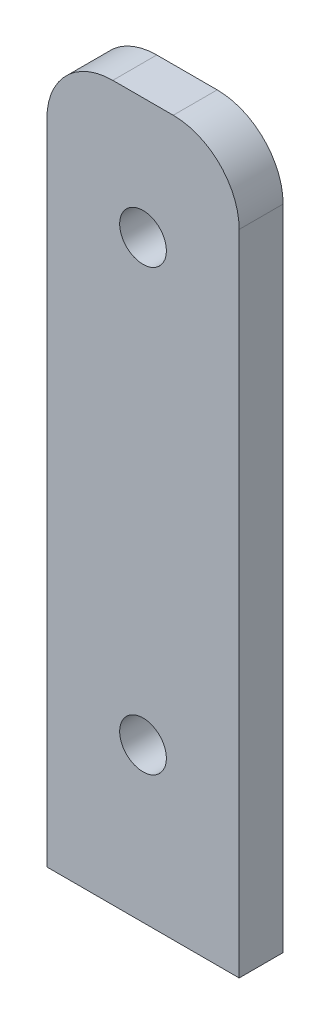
from build123d import *

# Parameters (mm, degrees)
ESQUISSE1_W        = 35
ESQUISSE1_H        = 130
EXTRUSION1_DEPTH   = 4
CONG_1_R           = 12
TROU_TARAUD_M101_D = 8.5


with BuildPart() as part:
    # Esquisse1 → Extrusion1 (new, symmetric)
    with BuildSketch(Plane.XY):
        with Locations((0, 65)):
            Rectangle(ESQUISSE1_W, ESQUISSE1_H)
    extrude(amount=EXTRUSION1_DEPTH, both=True)

    # Cong_1
    cong_1_edges = [part.edges().sort_by_distance(p)[0] for p in [
        (-17.5, 130, 0),
        (17.5, 130, 0),
    ]]
    fillet(cong_1_edges, radius=CONG_1_R)

    # Trou taraud_ M101 (through all)
    with Locations(Plane(origin=(0, 28, 4), x_dir=(1, 0, 0), z_dir=(0, 0, 1))):
        with Locations((0, 0), (0, 80)):
            Hole(TROU_TARAUD_M101_D / 2)


solid = part.part
